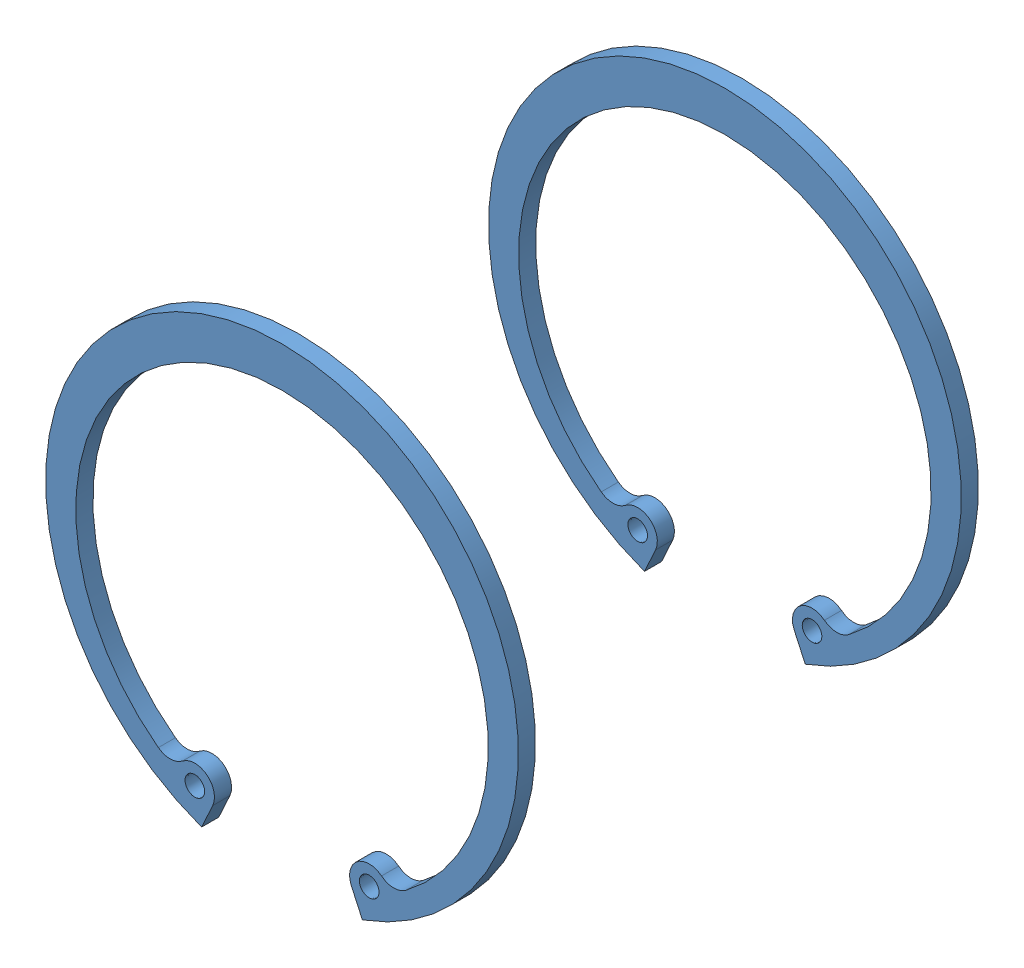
SolidWorks assembly JD50x30_1.sldasm, configuration 默认 (file format 8000). Lengths in mm.
Overall size (55.3 53.65 53.8).
3 component instances, 2 part files, 4 mates.
Components (placement in the parent):
- JD50x30-1: JD50x30.sldprt [默认] at (-3.0486 -0.7243 14.5352) (suppressed, hidden)
- R _X2_5F6274B0_X0_ 52-1: R _X2_5F6274B0_X0_ 52.sldprt [默认] at (-10.1061 27.245 68.8352) size (55.3 53.65 2)
- R _X2_5F6274B0_X0_ 52-2: R _X2_5F6274B0_X0_ 52.sldprt [默认] at (-10.1061 27.245 17.0352) size (55.3 53.65 2)
Mates (geometry in assembly coordinates):
- 同心1: concentric: cylinder of R _X2_5F6274B0_X0_ 52-1 through (-10.1061 1.07 68.8352) axis (0 0 1) radius 24.125; cylinder of R _X2_5F6274B0_X0_ 52-2 through (-10.1061 1.07 17.0352) axis (0 0 1) radius 24.125
- 距离1: distance = 49.8 mm anti-aligned: plane of R _X2_5F6274B0_X0_ 52-1 through (-10.1644 2.5063 68.8352) normal (0 0 -1); plane of R _X2_5F6274B0_X0_ 52-2 through (-10.1644 2.5063 19.0352) normal (0 0 1)
- 同心2: concentric: cylinder of JD50x30-1 through (-10.1061 1.07 72.9352) axis (0 0 -1) radius 19; cylinder of R _X2_5F6274B0_X0_ 52-1 through (-10.1061 1.07 68.8352) axis (0 0 1) radius 24.125
- 重合2: coincident anti-aligned: plane of JD50x30-1 through (-10.1061 23.57 68.8352) normal (0 0 1); plane of R _X2_5F6274B0_X0_ 52-1 through (-10.1644 2.5063 68.8352) normal (0 0 -1)
